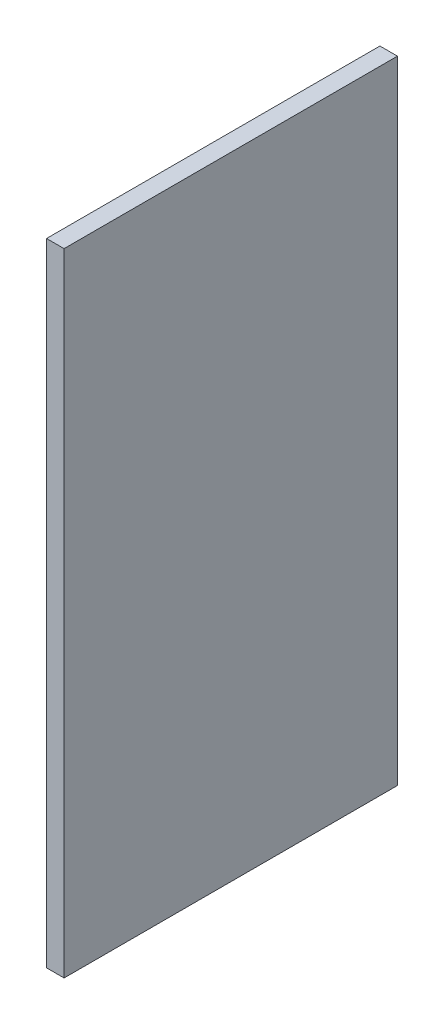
from build123d import *

# Parameters (mm, degrees)
SKETCH1_W           = 914.4
SKETCH1_H           = 482.6
BOSS_EXTRUDE1_DEPTH = 25.4


with BuildPart() as part:
    # Sketch1 → Boss-Extrude1 (new body)
    with BuildSketch(Plane.YZ):
        with Locations((457.2, 241.3)):
            Rectangle(SKETCH1_W, SKETCH1_H)
    extrude(amount=BOSS_EXTRUDE1_DEPTH)


solid = part.part
